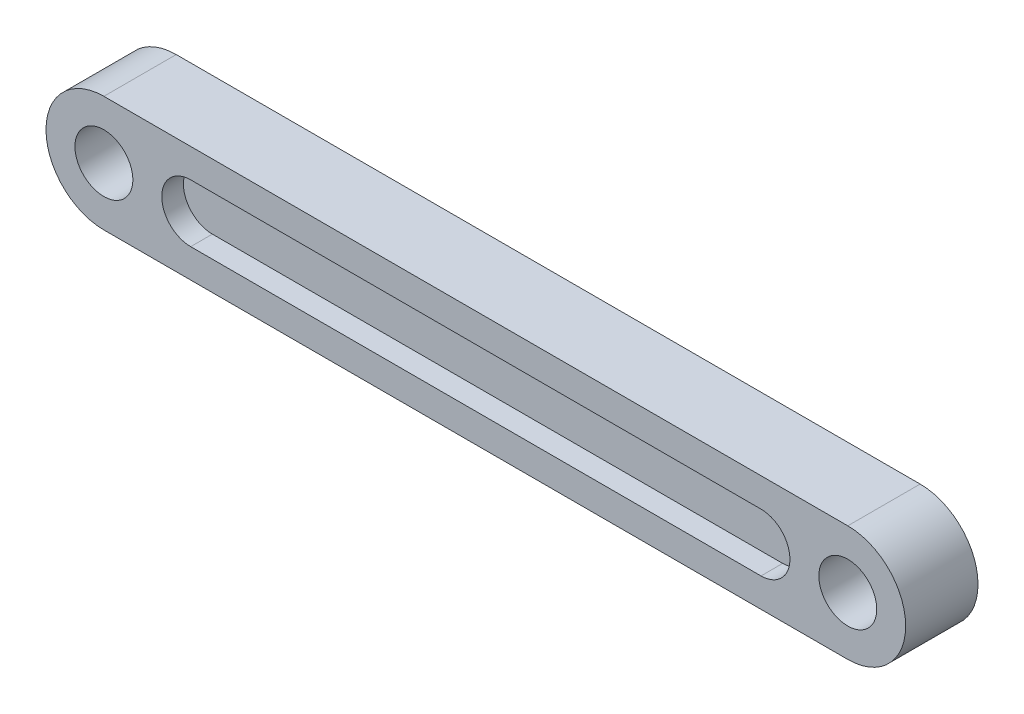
from build123d import *

# Parameters (mm, degrees)
BOSS_EXTRUDE1_DEPTH      = 5
CUT_EXTRUDE1_DEPTH       = 1.5
CUT_EXTRUDE2_DEPTH       = 1.5
F_4_0_4_DIAMETER_HOLE1_D = 4


with BuildPart() as part:
    # Sketch1 → Boss-Extrude1 (new body)
    with BuildSketch(Plane(origin=(0, 0, 0), x_dir=(-1, 0, 0), z_dir=(0, 0, -1))):
        with BuildLine():
            Line((0, 4), (-51.4197, 4))
            ThreePointArc((-51.4197, 4), (-55.4197, 0), (-51.4197, -4))
            Line((-51.4197, -4), (0, -4))
            ThreePointArc((0, -4), (4, 0), (0, 4))
        make_face()
    extrude(amount=-BOSS_EXTRUDE1_DEPTH)

    # Sketch2 → Cut-Extrude1 (cut)
    with BuildSketch(Plane(origin=(0, 0, 0), x_dir=(-1, 0, 0), z_dir=(0, 0, -1))):
        with BuildLine():
            Line((-6, 2.5), (-45.4197, 2.5))
            ThreePointArc((-45.4197, 2.5), (-47.9197, 0), (-45.4197, -2.5))
            Line((-45.4197, -2.5), (-6, -2.5))
            ThreePointArc((-6, -2.5), (-3.5, 0), (-6, 2.5))
        make_face()
    extrude(amount=-CUT_EXTRUDE1_DEPTH, mode=Mode.SUBTRACT)

    # Sketch3 → Cut-Extrude2 (cut)
    with BuildSketch(Plane.XY.offset(5)):
        with BuildLine():
            Line((6, -2), (45.4197, -2))
            ThreePointArc((45.4197, -2), (47.4197, 0), (45.4197, 2))
            Line((45.4197, 2), (6, 2))
            ThreePointArc((6, 2), (4, 0), (6, -2))
        make_face()
    extrude(amount=-CUT_EXTRUDE2_DEPTH, mode=Mode.SUBTRACT)

    # 4.0 _4_ Diameter Hole1 (through all)
    with Locations(Plane(origin=(0, 0, 0), x_dir=(-1, 0, 0), z_dir=(0, 0, -1))):
        with Locations((-51.4197, 0), (0, 0)):
            Hole(F_4_0_4_DIAMETER_HOLE1_D / 2)


solid = part.part
